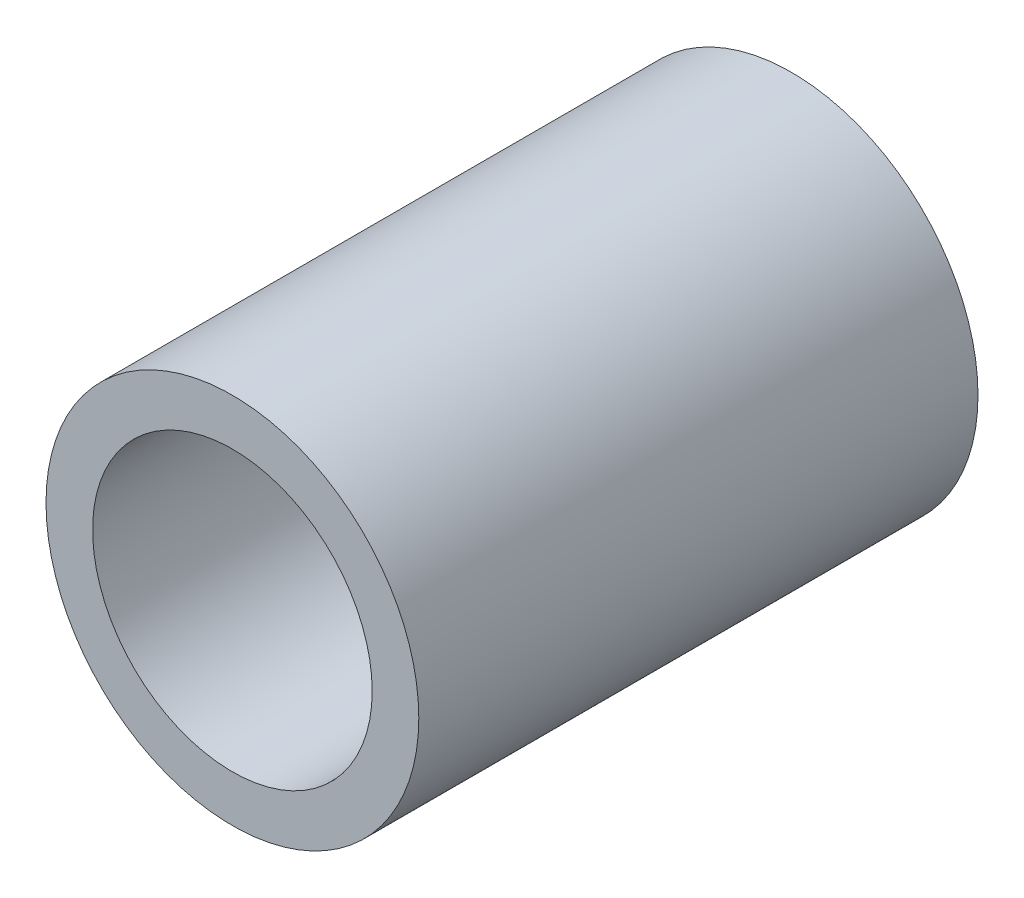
from build123d import *

# Parameters (mm, degrees)
ESQUISSE1_R          = 6
ESQUISSE1_R_2        = 4.5
BASE_EXTRUSION_DEPTH = 18


with BuildPart() as part:
    # Esquisse1 → Base-Extrusion (new body)
    with BuildSketch(Plane.XY):
        Circle(ESQUISSE1_R)
        Circle(ESQUISSE1_R_2, mode=Mode.SUBTRACT)
    extrude(amount=BASE_EXTRUSION_DEPTH)


solid = part.part
